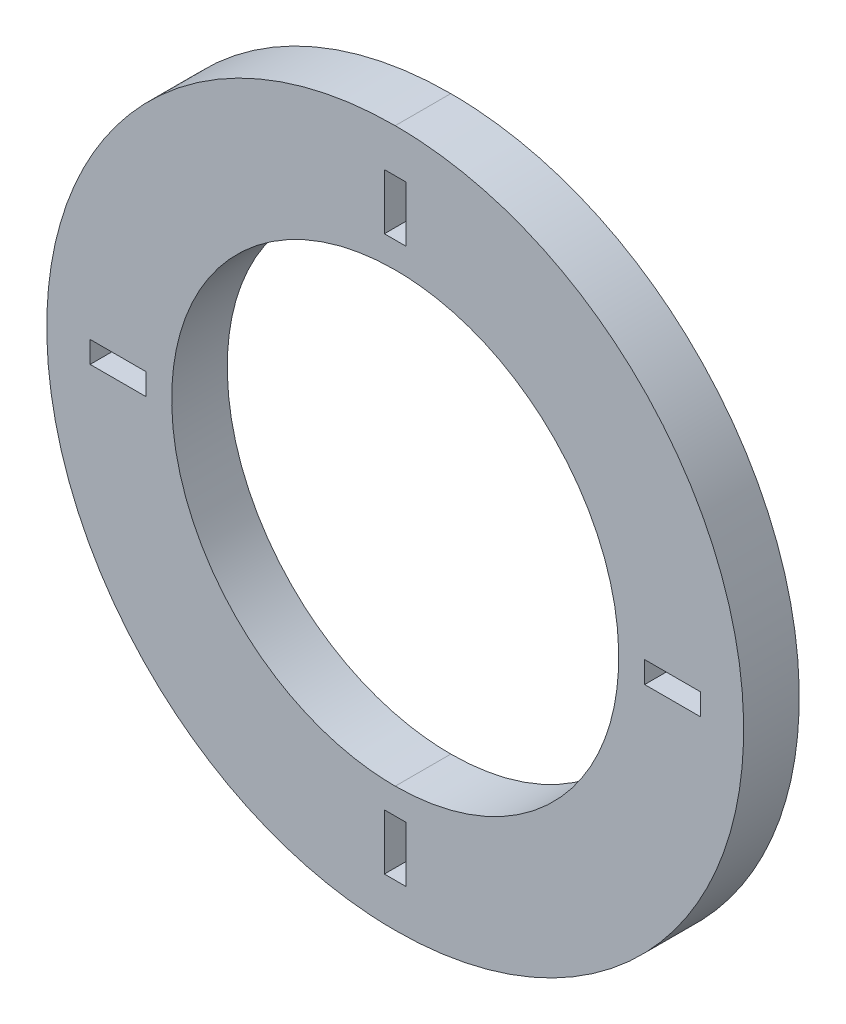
ISO-10303-21;
HEADER;
FILE_DESCRIPTION(('STEP AP214'),'2;1');
FILE_NAME('part.step','',(''),(''),'','','');
FILE_SCHEMA(('AUTOMOTIVE_DESIGN { 1 0 10303 214 1 1 1 1 }'));
ENDSEC;
DATA;
#1=APPLICATION_CONTEXT('core data for automotive mechanical design processes');
#2=APPLICATION_PROTOCOL_DEFINITION('international standard','automotive_design',2000,#1);
#3=PRODUCT_CONTEXT('',#1,'mechanical');
#4=PRODUCT('Part','Part','',(#3));
#5=PRODUCT_RELATED_PRODUCT_CATEGORY('part','',(#4));
#6=PRODUCT_DEFINITION_FORMATION('','',#4);
#7=PRODUCT_DEFINITION_CONTEXT('part definition',#1,'design');
#8=PRODUCT_DEFINITION('design','',#6,#7);
#9=PRODUCT_DEFINITION_SHAPE('','',#8);
#10=(LENGTH_UNIT() NAMED_UNIT(*) SI_UNIT(.MILLI.,.METRE.));
#11=(NAMED_UNIT(*) PLANE_ANGLE_UNIT() SI_UNIT($,.RADIAN.));
#12=(NAMED_UNIT(*) SI_UNIT($,.STERADIAN.) SOLID_ANGLE_UNIT());
#13=UNCERTAINTY_MEASURE_WITH_UNIT(LENGTH_MEASURE(1.E-05),#10,'distance_accuracy_value','');
#14=(GEOMETRIC_REPRESENTATION_CONTEXT(3) GLOBAL_UNCERTAINTY_ASSIGNED_CONTEXT((#13)) GLOBAL_UNIT_ASSIGNED_CONTEXT((#10,
#11,#12)) REPRESENTATION_CONTEXT('',''));
#15=CARTESIAN_POINT('',(0.,0.,0.));
#16=DIRECTION('',(0.,0.,1.));
#17=DIRECTION('',(1.,0.,0.));
#18=AXIS2_PLACEMENT_3D('',#15,#16,#17);
#19=CARTESIAN_POINT('',(231.78615355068,314.879839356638,3.));
#20=DIRECTION('',(0.,0.,-1.));
#21=DIRECTION('',(-1.,0.,0.));
#22=AXIS2_PLACEMENT_3D('',#19,#20,#21);
#23=PLANE('',#22);
#24=DIRECTION('',(0.,-1.,0.));
#25=VECTOR('',#24,1.);
#26=CARTESIAN_POINT('',(250.012092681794,328.344473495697,3.));
#27=LINE('',#26,#25);
#28=CARTESIAN_POINT('',(250.012092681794,331.346529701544,3.));
#29=VERTEX_POINT('',#28);
#30=CARTESIAN_POINT('',(250.012092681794,328.344473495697,3.));
#31=VERTEX_POINT('',#30);
#32=EDGE_CURVE('E235',#29,#31,#27,.T.);
#33=ORIENTED_EDGE('',*,*,#32,.F.);
#34=DIRECTION('',(-1.,0.,0.));
#35=VECTOR('',#34,1.);
#36=CARTESIAN_POINT('',(250.012092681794,331.346529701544,3.));
#37=LINE('',#36,#35);
#38=CARTESIAN_POINT('',(251.179807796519,331.346529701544,3.));
#39=VERTEX_POINT('',#38);
#40=EDGE_CURVE('E243',#39,#29,#37,.T.);
#41=ORIENTED_EDGE('',*,*,#40,.F.);
#42=DIRECTION('',(0.,1.,0.));
#43=VECTOR('',#42,1.);
#44=CARTESIAN_POINT('',(251.179807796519,331.346529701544,3.));
#45=LINE('',#44,#43);
#46=CARTESIAN_POINT('',(251.179807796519,328.344473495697,3.));
#47=VERTEX_POINT('',#46);
#48=EDGE_CURVE('E237',#47,#39,#45,.T.);
#49=ORIENTED_EDGE('',*,*,#48,.F.);
#50=DIRECTION('',(1.,0.,0.));
#51=VECTOR('',#50,1.);
#52=CARTESIAN_POINT('',(251.179807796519,328.344473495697,3.));
#53=LINE('',#52,#51);
#54=EDGE_CURVE('E232',#31,#47,#53,.T.);
#55=ORIENTED_EDGE('',*,*,#54,.F.);
#56=EDGE_LOOP('',(#33,#41,#49,#55));
#57=FACE_BOUND('',#56,.T.);
#58=CARTESIAN_POINT('',(250.595950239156,326.946109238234,3.));
#59=CARTESIAN_POINT('',(243.93188672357,326.946109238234,3.));
#60=CARTESIAN_POINT('',(238.529632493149,321.543855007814,3.));
#61=CARTESIAN_POINT('',(238.529632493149,314.879834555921,3.));
#62=CARTESIAN_POINT('',(238.529632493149,308.215641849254,3.));
#63=CARTESIAN_POINT('',(243.93188672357,302.813387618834,3.));
#64=CARTESIAN_POINT('',(250.595950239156,302.813387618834,3.));
#65=B_SPLINE_CURVE_WITH_KNOTS('',3,(#58,#59,#60,#61,#62,#63,#64),.UNSPECIFIED.,.F.,.F.,(4,3,4),
(0.,1.,2.),.UNSPECIFIED.);
#66=CARTESIAN_POINT('',(250.595950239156,326.946109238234,3.));
#67=VERTEX_POINT('',#66);
#68=CARTESIAN_POINT('',(250.595950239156,302.813387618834,3.));
#69=VERTEX_POINT('',#68);
#70=EDGE_CURVE('E319',#67,#69,#65,.T.);
#71=ORIENTED_EDGE('',*,*,#70,.F.);
#72=CARTESIAN_POINT('',(250.595950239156,302.813387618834,3.));
#73=CARTESIAN_POINT('',(257.260013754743,302.813387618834,3.));
#74=CARTESIAN_POINT('',(262.662267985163,308.215641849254,3.));
#75=CARTESIAN_POINT('',(262.662267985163,314.879834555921,3.));
#76=CARTESIAN_POINT('',(262.662267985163,321.543855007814,3.));
#77=CARTESIAN_POINT('',(257.260013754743,326.946109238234,3.));
#78=CARTESIAN_POINT('',(250.595950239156,326.946109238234,3.));
#79=B_SPLINE_CURVE_WITH_KNOTS('',3,(#72,#73,#74,#75,#76,#77,#78),.UNSPECIFIED.,.F.,.F.,(4,3,4),
(2.,3.,4.),.UNSPECIFIED.);
#80=EDGE_CURVE('E322',#69,#67,#79,.T.);
#81=ORIENTED_EDGE('',*,*,#80,.F.);
#82=EDGE_LOOP('',(#71,#81));
#83=FACE_BOUND('',#82,.T.);
#84=CARTESIAN_POINT('',(250.595950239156,333.689590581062,3.));
#85=CARTESIAN_POINT('',(240.207550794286,333.689590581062,3.));
#86=CARTESIAN_POINT('',(231.78615355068,325.268011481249,3.));
#87=CARTESIAN_POINT('',(231.78615355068,314.879839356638,3.));
#88=CARTESIAN_POINT('',(231.78615355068,304.491303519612,3.));
#89=CARTESIAN_POINT('',(240.207550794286,296.069906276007,3.));
#90=CARTESIAN_POINT('',(250.595950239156,296.069906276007,3.));
#91=B_SPLINE_CURVE_WITH_KNOTS('',3,(#84,#85,#86,#87,#88,#89,#90),.UNSPECIFIED.,.F.,.F.,(4,3,4),
(0.,1.,2.),.UNSPECIFIED.);
#92=CARTESIAN_POINT('',(250.595950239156,333.689590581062,3.));
#93=VERTEX_POINT('',#92);
#94=CARTESIAN_POINT('',(250.595950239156,296.069906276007,3.));
#95=VERTEX_POINT('',#94);
#96=EDGE_CURVE('E372',#93,#95,#91,.T.);
#97=ORIENTED_EDGE('',*,*,#96,.T.);
#98=CARTESIAN_POINT('',(250.595950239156,296.069906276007,3.));
#99=CARTESIAN_POINT('',(260.984349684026,296.069906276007,3.));
#100=CARTESIAN_POINT('',(269.405746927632,304.491303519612,3.));
#101=CARTESIAN_POINT('',(269.405746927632,314.879839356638,3.));
#102=CARTESIAN_POINT('',(269.405746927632,325.268011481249,3.));
#103=CARTESIAN_POINT('',(260.984349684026,333.689590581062,3.));
#104=CARTESIAN_POINT('',(250.595950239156,333.689590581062,3.));
#105=B_SPLINE_CURVE_WITH_KNOTS('',3,(#98,#99,#100,#101,#102,#103,#104),.UNSPECIFIED.,.F.,.F.,(4,
3,4),(2.,3.,4.),.UNSPECIFIED.);
#106=EDGE_CURVE('E368',#95,#93,#105,.T.);
#107=ORIENTED_EDGE('',*,*,#106,.T.);
#108=EDGE_LOOP('',(#97,#107));
#109=FACE_BOUND('',#108,.T.);
#110=DIRECTION('',(1.,0.,0.));
#111=VECTOR('',#110,1.);
#112=CARTESIAN_POINT('',(267.062731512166,314.295890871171,3.));
#113=LINE('',#112,#111);
#114=CARTESIAN_POINT('',(264.06067530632,314.295890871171,3.));
#115=VERTEX_POINT('',#114);
#116=CARTESIAN_POINT('',(267.062731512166,314.295890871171,3.));
#117=VERTEX_POINT('',#116);
#118=EDGE_CURVE('E433',#115,#117,#113,.T.);
#119=ORIENTED_EDGE('',*,*,#118,.F.);
#120=DIRECTION('',(0.,-1.,0.));
#121=VECTOR('',#120,1.);
#122=CARTESIAN_POINT('',(264.06067530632,314.295890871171,3.));
#123=LINE('',#122,#121);
#124=CARTESIAN_POINT('',(264.06067530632,315.463605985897,3.));
#125=VERTEX_POINT('',#124);
#126=EDGE_CURVE('E421',#125,#115,#123,.T.);
#127=ORIENTED_EDGE('',*,*,#126,.F.);
#128=DIRECTION('',(-1.,0.,0.));
#129=VECTOR('',#128,1.);
#130=CARTESIAN_POINT('',(264.06067530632,315.463605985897,3.));
#131=LINE('',#130,#129);
#132=CARTESIAN_POINT('',(267.062731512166,315.463605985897,3.));
#133=VERTEX_POINT('',#132);
#134=EDGE_CURVE('E428',#133,#125,#131,.T.);
#135=ORIENTED_EDGE('',*,*,#134,.F.);
#136=DIRECTION('',(0.,1.,0.));
#137=VECTOR('',#136,1.);
#138=CARTESIAN_POINT('',(267.062731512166,315.463605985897,3.));
#139=LINE('',#138,#137);
#140=EDGE_CURVE('E427',#117,#133,#139,.T.);
#141=ORIENTED_EDGE('',*,*,#140,.F.);
#142=EDGE_LOOP('',(#119,#127,#135,#141));
#143=FACE_BOUND('',#142,.T.);
#144=DIRECTION('',(0.,1.,0.));
#145=VECTOR('',#144,1.);
#146=CARTESIAN_POINT('',(251.179807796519,301.415023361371,3.));
#147=LINE('',#146,#145);
#148=CARTESIAN_POINT('',(251.179807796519,298.412967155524,3.));
#149=VERTEX_POINT('',#148);
#150=CARTESIAN_POINT('',(251.179807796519,301.415023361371,3.));
#151=VERTEX_POINT('',#150);
#152=EDGE_CURVE('E273',#149,#151,#147,.T.);
#153=ORIENTED_EDGE('',*,*,#152,.F.);
#154=DIRECTION('',(1.,0.,0.));
#155=VECTOR('',#154,1.);
#156=CARTESIAN_POINT('',(251.179807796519,298.412967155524,3.));
#157=LINE('',#156,#155);
#158=CARTESIAN_POINT('',(250.012092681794,298.412967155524,3.));
#159=VERTEX_POINT('',#158);
#160=EDGE_CURVE('E287',#159,#149,#157,.T.);
#161=ORIENTED_EDGE('',*,*,#160,.F.);
#162=DIRECTION('',(0.,-1.,0.));
#163=VECTOR('',#162,1.);
#164=CARTESIAN_POINT('',(250.012092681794,298.412967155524,3.));
#165=LINE('',#164,#163);
#166=CARTESIAN_POINT('',(250.012092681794,301.415023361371,3.));
#167=VERTEX_POINT('',#166);
#168=EDGE_CURVE('E282',#167,#159,#165,.T.);
#169=ORIENTED_EDGE('',*,*,#168,.F.);
#170=DIRECTION('',(-1.,0.,0.));
#171=VECTOR('',#170,1.);
#172=CARTESIAN_POINT('',(250.012092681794,301.415023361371,3.));
#173=LINE('',#172,#171);
#174=EDGE_CURVE('E280',#151,#167,#173,.T.);
#175=ORIENTED_EDGE('',*,*,#174,.F.);
#176=EDGE_LOOP('',(#153,#161,#169,#175));
#177=FACE_BOUND('',#176,.T.);
#178=DIRECTION('',(0.,1.,0.));
#179=VECTOR('',#178,1.);
#180=CARTESIAN_POINT('',(237.131225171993,315.463605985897,3.));
#181=LINE('',#180,#179);
#182=CARTESIAN_POINT('',(237.131225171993,314.295890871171,3.));
#183=VERTEX_POINT('',#182);
#184=CARTESIAN_POINT('',(237.131225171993,315.463605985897,3.));
#185=VERTEX_POINT('',#184);
#186=EDGE_CURVE('E183',#183,#185,#181,.T.);
#187=ORIENTED_EDGE('',*,*,#186,.F.);
#188=DIRECTION('',(1.,0.,0.));
#189=VECTOR('',#188,1.);
#190=CARTESIAN_POINT('',(237.131225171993,314.295890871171,3.));
#191=LINE('',#190,#189);
#192=CARTESIAN_POINT('',(234.129168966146,314.295890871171,3.));
#193=VERTEX_POINT('',#192);
#194=EDGE_CURVE('E208',#193,#183,#191,.T.);
#195=ORIENTED_EDGE('',*,*,#194,.F.);
#196=DIRECTION('',(0.,-1.,0.));
#197=VECTOR('',#196,1.);
#198=CARTESIAN_POINT('',(234.129168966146,314.295890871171,3.));
#199=LINE('',#198,#197);
#200=CARTESIAN_POINT('',(234.129168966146,315.463605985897,3.));
#201=VERTEX_POINT('',#200);
#202=EDGE_CURVE('E207',#201,#193,#199,.T.);
#203=ORIENTED_EDGE('',*,*,#202,.F.);
#204=DIRECTION('',(-1.,0.,0.));
#205=VECTOR('',#204,1.);
#206=CARTESIAN_POINT('',(234.129168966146,315.463605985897,3.));
#207=LINE('',#206,#205);
#208=EDGE_CURVE('E195',#185,#201,#207,.T.);
#209=ORIENTED_EDGE('',*,*,#208,.F.);
#210=EDGE_LOOP('',(#187,#195,#203,#209));
#211=FACE_BOUND('',#210,.T.);
#212=ADVANCED_FACE('F44',(#57,#83,#109,#143,#177,#211),#23,.F.);
#213=CARTESIAN_POINT('',(231.78615355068,314.879839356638,0.));
#214=DIRECTION('',(0.,0.,-1.));
#215=DIRECTION('',(-1.,0.,0.));
#216=AXIS2_PLACEMENT_3D('',#213,#214,#215);
#217=PLANE('',#216);
#218=CARTESIAN_POINT('',(250.595950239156,333.689590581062,0.));
#219=CARTESIAN_POINT('',(240.207550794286,333.689590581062,0.));
#220=CARTESIAN_POINT('',(231.78615355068,325.268011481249,0.));
#221=CARTESIAN_POINT('',(231.78615355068,314.879839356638,0.));
#222=CARTESIAN_POINT('',(231.78615355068,304.491303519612,0.));
#223=CARTESIAN_POINT('',(240.207550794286,296.069906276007,0.));
#224=CARTESIAN_POINT('',(250.595950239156,296.069906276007,0.));
#225=B_SPLINE_CURVE_WITH_KNOTS('',3,(#218,#219,#220,#221,#222,#223,#224),.UNSPECIFIED.,.F.,.F.,
(4,3,4),(0.,1.,2.),.UNSPECIFIED.);
#226=CARTESIAN_POINT('',(250.595950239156,333.689590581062,0.));
#227=VERTEX_POINT('',#226);
#228=CARTESIAN_POINT('',(250.595950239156,296.069906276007,0.));
#229=VERTEX_POINT('',#228);
#230=EDGE_CURVE('E378',#227,#229,#225,.T.);
#231=ORIENTED_EDGE('',*,*,#230,.F.);
#232=CARTESIAN_POINT('',(250.595950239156,296.069906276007,0.));
#233=CARTESIAN_POINT('',(260.984349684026,296.069906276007,0.));
#234=CARTESIAN_POINT('',(269.405746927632,304.491303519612,0.));
#235=CARTESIAN_POINT('',(269.405746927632,314.879839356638,0.));
#236=CARTESIAN_POINT('',(269.405746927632,325.268011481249,0.));
#237=CARTESIAN_POINT('',(260.984349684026,333.689590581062,0.));
#238=CARTESIAN_POINT('',(250.595950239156,333.689590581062,0.));
#239=B_SPLINE_CURVE_WITH_KNOTS('',3,(#232,#233,#234,#235,#236,#237,#238),.UNSPECIFIED.,.F.,.F.,
(4,3,4),(2.,3.,4.),.UNSPECIFIED.);
#240=EDGE_CURVE('E390',#229,#227,#239,.T.);
#241=ORIENTED_EDGE('',*,*,#240,.F.);
#242=EDGE_LOOP('',(#231,#241));
#243=FACE_BOUND('',#242,.T.);
#244=DIRECTION('',(0.,-1.,0.));
#245=VECTOR('',#244,1.);
#246=CARTESIAN_POINT('',(264.06067530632,314.295890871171,0.));
#247=LINE('',#246,#245);
#248=CARTESIAN_POINT('',(264.06067530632,315.463605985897,0.));
#249=VERTEX_POINT('',#248);
#250=CARTESIAN_POINT('',(264.06067530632,314.295890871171,0.));
#251=VERTEX_POINT('',#250);
#252=EDGE_CURVE('E436',#249,#251,#247,.T.);
#253=ORIENTED_EDGE('',*,*,#252,.T.);
#254=DIRECTION('',(1.,0.,0.));
#255=VECTOR('',#254,1.);
#256=CARTESIAN_POINT('',(267.062731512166,314.295890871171,0.));
#257=LINE('',#256,#255);
#258=CARTESIAN_POINT('',(267.062731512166,314.295890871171,0.));
#259=VERTEX_POINT('',#258);
#260=EDGE_CURVE('E449',#251,#259,#257,.T.);
#261=ORIENTED_EDGE('',*,*,#260,.T.);
#262=DIRECTION('',(0.,1.,0.));
#263=VECTOR('',#262,1.);
#264=CARTESIAN_POINT('',(267.062731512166,315.463605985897,0.));
#265=LINE('',#264,#263);
#266=CARTESIAN_POINT('',(267.062731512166,315.463605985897,0.));
#267=VERTEX_POINT('',#266);
#268=EDGE_CURVE('E443',#259,#267,#265,.T.);
#269=ORIENTED_EDGE('',*,*,#268,.T.);
#270=DIRECTION('',(-1.,0.,0.));
#271=VECTOR('',#270,1.);
#272=CARTESIAN_POINT('',(264.06067530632,315.463605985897,0.));
#273=LINE('',#272,#271);
#274=EDGE_CURVE('E439',#267,#249,#273,.T.);
#275=ORIENTED_EDGE('',*,*,#274,.T.);
#276=EDGE_LOOP('',(#253,#261,#269,#275));
#277=FACE_BOUND('',#276,.T.);
#278=CARTESIAN_POINT('',(250.595950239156,302.813387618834,0.));
#279=CARTESIAN_POINT('',(257.260013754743,302.813387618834,0.));
#280=CARTESIAN_POINT('',(262.662267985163,308.215641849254,0.));
#281=CARTESIAN_POINT('',(262.662267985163,314.879834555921,0.));
#282=CARTESIAN_POINT('',(262.662267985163,321.543855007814,0.));
#283=CARTESIAN_POINT('',(257.260013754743,326.946109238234,0.));
#284=CARTESIAN_POINT('',(250.595950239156,326.946109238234,0.));
#285=B_SPLINE_CURVE_WITH_KNOTS('',3,(#278,#279,#280,#281,#282,#283,#284),.UNSPECIFIED.,.F.,.F.,
(4,3,4),(2.,3.,4.),.UNSPECIFIED.);
#286=CARTESIAN_POINT('',(250.595950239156,302.813387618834,0.));
#287=VERTEX_POINT('',#286);
#288=CARTESIAN_POINT('',(250.595950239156,326.946109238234,0.));
#289=VERTEX_POINT('',#288);
#290=EDGE_CURVE('E326',#287,#289,#285,.T.);
#291=ORIENTED_EDGE('',*,*,#290,.T.);
#292=CARTESIAN_POINT('',(250.595950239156,326.946109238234,0.));
#293=CARTESIAN_POINT('',(243.93188672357,326.946109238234,0.));
#294=CARTESIAN_POINT('',(238.529632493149,321.543855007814,0.));
#295=CARTESIAN_POINT('',(238.529632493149,314.879834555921,0.));
#296=CARTESIAN_POINT('',(238.529632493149,308.215641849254,0.));
#297=CARTESIAN_POINT('',(243.93188672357,302.813387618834,0.));
#298=CARTESIAN_POINT('',(250.595950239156,302.813387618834,0.));
#299=B_SPLINE_CURVE_WITH_KNOTS('',3,(#292,#293,#294,#295,#296,#297,#298),.UNSPECIFIED.,.F.,.F.,
(4,3,4),(0.,1.,2.),.UNSPECIFIED.);
#300=EDGE_CURVE('E320',#289,#287,#299,.T.);
#301=ORIENTED_EDGE('',*,*,#300,.T.);
#302=EDGE_LOOP('',(#291,#301));
#303=FACE_BOUND('',#302,.T.);
#304=DIRECTION('',(1.,0.,0.));
#305=VECTOR('',#304,1.);
#306=CARTESIAN_POINT('',(251.179807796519,298.412967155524,0.));
#307=LINE('',#306,#305);
#308=CARTESIAN_POINT('',(250.012092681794,298.412967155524,0.));
#309=VERTEX_POINT('',#308);
#310=CARTESIAN_POINT('',(251.179807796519,298.412967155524,0.));
#311=VERTEX_POINT('',#310);
#312=EDGE_CURVE('E278',#309,#311,#307,.T.);
#313=ORIENTED_EDGE('',*,*,#312,.T.);
#314=DIRECTION('',(0.,1.,0.));
#315=VECTOR('',#314,1.);
#316=CARTESIAN_POINT('',(251.179807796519,301.415023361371,0.));
#317=LINE('',#316,#315);
#318=CARTESIAN_POINT('',(251.179807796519,301.415023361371,0.));
#319=VERTEX_POINT('',#318);
#320=EDGE_CURVE('E274',#311,#319,#317,.T.);
#321=ORIENTED_EDGE('',*,*,#320,.T.);
#322=DIRECTION('',(-1.,0.,0.));
#323=VECTOR('',#322,1.);
#324=CARTESIAN_POINT('',(250.012092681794,301.415023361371,0.));
#325=LINE('',#324,#323);
#326=CARTESIAN_POINT('',(250.012092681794,301.415023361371,0.));
#327=VERTEX_POINT('',#326);
#328=EDGE_CURVE('E291',#319,#327,#325,.T.);
#329=ORIENTED_EDGE('',*,*,#328,.T.);
#330=DIRECTION('',(0.,-1.,0.));
#331=VECTOR('',#330,1.);
#332=CARTESIAN_POINT('',(250.012092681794,298.412967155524,0.));
#333=LINE('',#332,#331);
#334=EDGE_CURVE('E300',#327,#309,#333,.T.);
#335=ORIENTED_EDGE('',*,*,#334,.T.);
#336=EDGE_LOOP('',(#313,#321,#329,#335));
#337=FACE_BOUND('',#336,.T.);
#338=DIRECTION('',(-1.,0.,0.));
#339=VECTOR('',#338,1.);
#340=CARTESIAN_POINT('',(250.012092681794,331.346529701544,0.));
#341=LINE('',#340,#339);
#342=CARTESIAN_POINT('',(251.179807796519,331.346529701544,0.));
#343=VERTEX_POINT('',#342);
#344=CARTESIAN_POINT('',(250.012092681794,331.346529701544,0.));
#345=VERTEX_POINT('',#344);
#346=EDGE_CURVE('E236',#343,#345,#341,.T.);
#347=ORIENTED_EDGE('',*,*,#346,.T.);
#348=DIRECTION('',(0.,-1.,0.));
#349=VECTOR('',#348,1.);
#350=CARTESIAN_POINT('',(250.012092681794,328.344473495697,0.));
#351=LINE('',#350,#349);
#352=CARTESIAN_POINT('',(250.012092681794,328.344473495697,0.));
#353=VERTEX_POINT('',#352);
#354=EDGE_CURVE('E205',#345,#353,#351,.T.);
#355=ORIENTED_EDGE('',*,*,#354,.T.);
#356=DIRECTION('',(1.,0.,0.));
#357=VECTOR('',#356,1.);
#358=CARTESIAN_POINT('',(251.179807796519,328.344473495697,0.));
#359=LINE('',#358,#357);
#360=CARTESIAN_POINT('',(251.179807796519,328.344473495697,0.));
#361=VERTEX_POINT('',#360);
#362=EDGE_CURVE('E249',#353,#361,#359,.T.);
#363=ORIENTED_EDGE('',*,*,#362,.T.);
#364=DIRECTION('',(0.,1.,0.));
#365=VECTOR('',#364,1.);
#366=CARTESIAN_POINT('',(251.179807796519,331.346529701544,0.));
#367=LINE('',#366,#365);
#368=EDGE_CURVE('E251',#361,#343,#367,.T.);
#369=ORIENTED_EDGE('',*,*,#368,.T.);
#370=EDGE_LOOP('',(#347,#355,#363,#369));
#371=FACE_BOUND('',#370,.T.);
#372=DIRECTION('',(1.,0.,0.));
#373=VECTOR('',#372,1.);
#374=CARTESIAN_POINT('',(237.131225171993,314.295890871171,0.));
#375=LINE('',#374,#373);
#376=CARTESIAN_POINT('',(234.129168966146,314.295890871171,0.));
#377=VERTEX_POINT('',#376);
#378=CARTESIAN_POINT('',(237.131225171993,314.295890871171,0.));
#379=VERTEX_POINT('',#378);
#380=EDGE_CURVE('E193',#377,#379,#375,.T.);
#381=ORIENTED_EDGE('',*,*,#380,.T.);
#382=DIRECTION('',(0.,1.,0.));
#383=VECTOR('',#382,1.);
#384=CARTESIAN_POINT('',(237.131225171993,315.463605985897,0.));
#385=LINE('',#384,#383);
#386=CARTESIAN_POINT('',(237.131225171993,315.463605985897,0.));
#387=VERTEX_POINT('',#386);
#388=EDGE_CURVE('E70',#379,#387,#385,.T.);
#389=ORIENTED_EDGE('',*,*,#388,.T.);
#390=DIRECTION('',(-1.,0.,0.));
#391=VECTOR('',#390,1.);
#392=CARTESIAN_POINT('',(234.129168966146,315.463605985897,0.));
#393=LINE('',#392,#391);
#394=CARTESIAN_POINT('',(234.129168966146,315.463605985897,0.));
#395=VERTEX_POINT('',#394);
#396=EDGE_CURVE('E200',#387,#395,#393,.T.);
#397=ORIENTED_EDGE('',*,*,#396,.T.);
#398=DIRECTION('',(0.,-1.,0.));
#399=VECTOR('',#398,1.);
#400=CARTESIAN_POINT('',(234.129168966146,314.295890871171,0.));
#401=LINE('',#400,#399);
#402=EDGE_CURVE('E218',#395,#377,#401,.T.);
#403=ORIENTED_EDGE('',*,*,#402,.T.);
#404=EDGE_LOOP('',(#381,#389,#397,#403));
#405=FACE_BOUND('',#404,.T.);
#406=ADVANCED_FACE('F363',(#243,#277,#303,#337,#371,#405),#217,.T.);
#407=DIRECTION('',(0.,0.,-1.));
#408=VECTOR('',#407,1.);
#409=SURFACE_OF_LINEAR_EXTRUSION('',#91,#408);
#410=ORIENTED_EDGE('',*,*,#230,.T.);
#411=DIRECTION('',(0.,0.,-1.));
#412=VECTOR('',#411,1.);
#413=CARTESIAN_POINT('',(250.595950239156,296.069906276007,3.));
#414=LINE('',#413,#412);
#415=EDGE_CURVE('E11',#95,#229,#414,.T.);
#416=ORIENTED_EDGE('',*,*,#415,.F.);
#417=ORIENTED_EDGE('',*,*,#96,.F.);
#418=DIRECTION('',(0.,0.,-1.));
#419=VECTOR('',#418,1.);
#420=CARTESIAN_POINT('',(250.595950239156,333.689590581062,3.));
#421=LINE('',#420,#419);
#422=EDGE_CURVE('E54',#93,#227,#421,.T.);
#423=ORIENTED_EDGE('',*,*,#422,.T.);
#424=EDGE_LOOP('',(#410,#416,#417,#423));
#425=FACE_BOUND('',#424,.T.);
#426=ADVANCED_FACE('F50',(#425),#409,.F.);
#427=DIRECTION('',(0.,0.,-1.));
#428=VECTOR('',#427,1.);
#429=SURFACE_OF_LINEAR_EXTRUSION('',#105,#428);
#430=ORIENTED_EDGE('',*,*,#240,.T.);
#431=ORIENTED_EDGE('',*,*,#422,.F.);
#432=ORIENTED_EDGE('',*,*,#106,.F.);
#433=ORIENTED_EDGE('',*,*,#415,.T.);
#434=EDGE_LOOP('',(#430,#431,#432,#433));
#435=FACE_BOUND('',#434,.T.);
#436=ADVANCED_FACE('F357',(#435),#429,.F.);
#437=CARTESIAN_POINT('',(267.062731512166,314.295890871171,3.));
#438=DIRECTION('',(0.,1.,0.));
#439=DIRECTION('',(0.,0.,1.));
#440=AXIS2_PLACEMENT_3D('',#437,#438,#439);
#441=PLANE('',#440);
#442=ORIENTED_EDGE('',*,*,#260,.F.);
#443=DIRECTION('',(0.,0.,-1.));
#444=VECTOR('',#443,1.);
#445=CARTESIAN_POINT('',(264.06067530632,314.295890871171,3.));
#446=LINE('',#445,#444);
#447=EDGE_CURVE('E416',#115,#251,#446,.T.);
#448=ORIENTED_EDGE('',*,*,#447,.F.);
#449=ORIENTED_EDGE('',*,*,#118,.T.);
#450=DIRECTION('',(0.,0.,-1.));
#451=VECTOR('',#450,1.);
#452=CARTESIAN_POINT('',(267.062731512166,314.295890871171,3.));
#453=LINE('',#452,#451);
#454=EDGE_CURVE('E388',#117,#259,#453,.T.);
#455=ORIENTED_EDGE('',*,*,#454,.T.);
#456=EDGE_LOOP('',(#442,#448,#449,#455));
#457=FACE_BOUND('',#456,.T.);
#458=ADVANCED_FACE('F354',(#457),#441,.T.);
#459=CARTESIAN_POINT('',(267.062731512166,315.463605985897,3.));
#460=DIRECTION('',(-1.,0.,0.));
#461=DIRECTION('',(0.,0.,1.));
#462=AXIS2_PLACEMENT_3D('',#459,#460,#461);
#463=PLANE('',#462);
#464=ORIENTED_EDGE('',*,*,#268,.F.);
#465=ORIENTED_EDGE('',*,*,#454,.F.);
#466=ORIENTED_EDGE('',*,*,#140,.T.);
#467=DIRECTION('',(0.,0.,-1.));
#468=VECTOR('',#467,1.);
#469=CARTESIAN_POINT('',(267.062731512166,315.463605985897,3.));
#470=LINE('',#469,#468);
#471=EDGE_CURVE('E413',#133,#267,#470,.T.);
#472=ORIENTED_EDGE('',*,*,#471,.T.);
#473=EDGE_LOOP('',(#464,#465,#466,#472));
#474=FACE_BOUND('',#473,.T.);
#475=ADVANCED_FACE('F348',(#474),#463,.T.);
#476=CARTESIAN_POINT('',(264.06067530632,315.463605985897,3.));
#477=DIRECTION('',(0.,-1.,0.));
#478=DIRECTION('',(0.,0.,-1.));
#479=AXIS2_PLACEMENT_3D('',#476,#477,#478);
#480=PLANE('',#479);
#481=ORIENTED_EDGE('',*,*,#274,.F.);
#482=ORIENTED_EDGE('',*,*,#471,.F.);
#483=ORIENTED_EDGE('',*,*,#134,.T.);
#484=DIRECTION('',(0.,0.,-1.));
#485=VECTOR('',#484,1.);
#486=CARTESIAN_POINT('',(264.06067530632,315.463605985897,3.));
#487=LINE('',#486,#485);
#488=EDGE_CURVE('E417',#125,#249,#487,.T.);
#489=ORIENTED_EDGE('',*,*,#488,.T.);
#490=EDGE_LOOP('',(#481,#482,#483,#489));
#491=FACE_BOUND('',#490,.T.);
#492=ADVANCED_FACE('F342',(#491),#480,.T.);
#493=CARTESIAN_POINT('',(264.06067530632,314.295890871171,3.));
#494=DIRECTION('',(1.,0.,0.));
#495=DIRECTION('',(0.,0.,-1.));
#496=AXIS2_PLACEMENT_3D('',#493,#494,#495);
#497=PLANE('',#496);
#498=ORIENTED_EDGE('',*,*,#252,.F.);
#499=ORIENTED_EDGE('',*,*,#488,.F.);
#500=ORIENTED_EDGE('',*,*,#126,.T.);
#501=ORIENTED_EDGE('',*,*,#447,.T.);
#502=EDGE_LOOP('',(#498,#499,#500,#501));
#503=FACE_BOUND('',#502,.T.);
#504=ADVANCED_FACE('F338',(#503),#497,.T.);
#505=DIRECTION('',(0.,0.,-1.));
#506=VECTOR('',#505,1.);
#507=SURFACE_OF_LINEAR_EXTRUSION('',#65,#506);
#508=ORIENTED_EDGE('',*,*,#300,.F.);
#509=DIRECTION('',(0.,0.,-1.));
#510=VECTOR('',#509,1.);
#511=CARTESIAN_POINT('',(250.595950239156,326.946109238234,3.));
#512=LINE('',#511,#510);
#513=EDGE_CURVE('E456',#67,#289,#512,.T.);
#514=ORIENTED_EDGE('',*,*,#513,.F.);
#515=ORIENTED_EDGE('',*,*,#70,.T.);
#516=DIRECTION('',(0.,0.,-1.));
#517=VECTOR('',#516,1.);
#518=CARTESIAN_POINT('',(250.595950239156,302.813387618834,3.));
#519=LINE('',#518,#517);
#520=EDGE_CURVE('E451',#69,#287,#519,.T.);
#521=ORIENTED_EDGE('',*,*,#520,.T.);
#522=EDGE_LOOP('',(#508,#514,#515,#521));
#523=FACE_BOUND('',#522,.T.);
#524=ADVANCED_FACE('F333',(#523),#507,.T.);
#525=DIRECTION('',(0.,0.,-1.));
#526=VECTOR('',#525,1.);
#527=SURFACE_OF_LINEAR_EXTRUSION('',#79,#526);
#528=ORIENTED_EDGE('',*,*,#290,.F.);
#529=ORIENTED_EDGE('',*,*,#520,.F.);
#530=ORIENTED_EDGE('',*,*,#80,.T.);
#531=ORIENTED_EDGE('',*,*,#513,.T.);
#532=EDGE_LOOP('',(#528,#529,#530,#531));
#533=FACE_BOUND('',#532,.T.);
#534=ADVANCED_FACE('F339',(#533),#527,.T.);
#535=CARTESIAN_POINT('',(251.179807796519,301.415023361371,3.));
#536=DIRECTION('',(-1.,0.,0.));
#537=DIRECTION('',(0.,0.,1.));
#538=AXIS2_PLACEMENT_3D('',#535,#536,#537);
#539=PLANE('',#538);
#540=ORIENTED_EDGE('',*,*,#320,.F.);
#541=DIRECTION('',(0.,0.,-1.));
#542=VECTOR('',#541,1.);
#543=CARTESIAN_POINT('',(251.179807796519,298.412967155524,3.));
#544=LINE('',#543,#542);
#545=EDGE_CURVE('E286',#149,#311,#544,.T.);
#546=ORIENTED_EDGE('',*,*,#545,.F.);
#547=ORIENTED_EDGE('',*,*,#152,.T.);
#548=DIRECTION('',(0.,0.,-1.));
#549=VECTOR('',#548,1.);
#550=CARTESIAN_POINT('',(251.179807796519,301.415023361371,3.));
#551=LINE('',#550,#549);
#552=EDGE_CURVE('E312',#151,#319,#551,.T.);
#553=ORIENTED_EDGE('',*,*,#552,.T.);
#554=EDGE_LOOP('',(#540,#546,#547,#553));
#555=FACE_BOUND('',#554,.T.);
#556=ADVANCED_FACE('F481',(#555),#539,.T.);
#557=CARTESIAN_POINT('',(250.012092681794,301.415023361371,3.));
#558=DIRECTION('',(0.,-1.,0.));
#559=DIRECTION('',(0.,0.,-1.));
#560=AXIS2_PLACEMENT_3D('',#557,#558,#559);
#561=PLANE('',#560);
#562=ORIENTED_EDGE('',*,*,#328,.F.);
#563=ORIENTED_EDGE('',*,*,#552,.F.);
#564=ORIENTED_EDGE('',*,*,#174,.T.);
#565=DIRECTION('',(0.,0.,-1.));
#566=VECTOR('',#565,1.);
#567=CARTESIAN_POINT('',(250.012092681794,301.415023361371,3.));
#568=LINE('',#567,#566);
#569=EDGE_CURVE('E309',#167,#327,#568,.T.);
#570=ORIENTED_EDGE('',*,*,#569,.T.);
#571=EDGE_LOOP('',(#562,#563,#564,#570));
#572=FACE_BOUND('',#571,.T.);
#573=ADVANCED_FACE('F486',(#572),#561,.T.);
#574=CARTESIAN_POINT('',(250.012092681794,298.412967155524,3.));
#575=DIRECTION('',(1.,0.,0.));
#576=DIRECTION('',(0.,0.,-1.));
#577=AXIS2_PLACEMENT_3D('',#574,#575,#576);
#578=PLANE('',#577);
#579=ORIENTED_EDGE('',*,*,#334,.F.);
#580=ORIENTED_EDGE('',*,*,#569,.F.);
#581=ORIENTED_EDGE('',*,*,#168,.T.);
#582=DIRECTION('',(0.,0.,-1.));
#583=VECTOR('',#582,1.);
#584=CARTESIAN_POINT('',(250.012092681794,298.412967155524,3.));
#585=LINE('',#584,#583);
#586=EDGE_CURVE('E310',#159,#309,#585,.T.);
#587=ORIENTED_EDGE('',*,*,#586,.T.);
#588=EDGE_LOOP('',(#579,#580,#581,#587));
#589=FACE_BOUND('',#588,.T.);
#590=ADVANCED_FACE('F491',(#589),#578,.T.);
#591=CARTESIAN_POINT('',(251.179807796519,298.412967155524,3.));
#592=DIRECTION('',(0.,1.,0.));
#593=DIRECTION('',(0.,0.,1.));
#594=AXIS2_PLACEMENT_3D('',#591,#592,#593);
#595=PLANE('',#594);
#596=ORIENTED_EDGE('',*,*,#312,.F.);
#597=ORIENTED_EDGE('',*,*,#586,.F.);
#598=ORIENTED_EDGE('',*,*,#160,.T.);
#599=ORIENTED_EDGE('',*,*,#545,.T.);
#600=EDGE_LOOP('',(#596,#597,#598,#599));
#601=FACE_BOUND('',#600,.T.);
#602=ADVANCED_FACE('F497',(#601),#595,.T.);
#603=CARTESIAN_POINT('',(250.012092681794,328.344473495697,3.));
#604=DIRECTION('',(1.,0.,0.));
#605=DIRECTION('',(0.,0.,-1.));
#606=AXIS2_PLACEMENT_3D('',#603,#604,#605);
#607=PLANE('',#606);
#608=ORIENTED_EDGE('',*,*,#354,.F.);
#609=DIRECTION('',(0.,0.,-1.));
#610=VECTOR('',#609,1.);
#611=CARTESIAN_POINT('',(250.012092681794,331.346529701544,3.));
#612=LINE('',#611,#610);
#613=EDGE_CURVE('E246',#29,#345,#612,.T.);
#614=ORIENTED_EDGE('',*,*,#613,.F.);
#615=ORIENTED_EDGE('',*,*,#32,.T.);
#616=DIRECTION('',(0.,0.,-1.));
#617=VECTOR('',#616,1.);
#618=CARTESIAN_POINT('',(250.012092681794,328.344473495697,3.));
#619=LINE('',#618,#617);
#620=EDGE_CURVE('E268',#31,#353,#619,.T.);
#621=ORIENTED_EDGE('',*,*,#620,.T.);
#622=EDGE_LOOP('',(#608,#614,#615,#621));
#623=FACE_BOUND('',#622,.T.);
#624=ADVANCED_FACE('F503',(#623),#607,.T.);
#625=CARTESIAN_POINT('',(251.179807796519,328.344473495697,3.));
#626=DIRECTION('',(0.,1.,0.));
#627=DIRECTION('',(0.,0.,1.));
#628=AXIS2_PLACEMENT_3D('',#625,#626,#627);
#629=PLANE('',#628);
#630=ORIENTED_EDGE('',*,*,#362,.F.);
#631=ORIENTED_EDGE('',*,*,#620,.F.);
#632=ORIENTED_EDGE('',*,*,#54,.T.);
#633=DIRECTION('',(0.,0.,-1.));
#634=VECTOR('',#633,1.);
#635=CARTESIAN_POINT('',(251.179807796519,328.344473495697,3.));
#636=LINE('',#635,#634);
#637=EDGE_CURVE('E270',#47,#361,#636,.T.);
#638=ORIENTED_EDGE('',*,*,#637,.T.);
#639=EDGE_LOOP('',(#630,#631,#632,#638));
#640=FACE_BOUND('',#639,.T.);
#641=ADVANCED_FACE('F510',(#640),#629,.T.);
#642=CARTESIAN_POINT('',(251.179807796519,331.346529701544,3.));
#643=DIRECTION('',(-1.,0.,0.));
#644=DIRECTION('',(0.,0.,1.));
#645=AXIS2_PLACEMENT_3D('',#642,#643,#644);
#646=PLANE('',#645);
#647=ORIENTED_EDGE('',*,*,#368,.F.);
#648=ORIENTED_EDGE('',*,*,#637,.F.);
#649=ORIENTED_EDGE('',*,*,#48,.T.);
#650=DIRECTION('',(0.,0.,-1.));
#651=VECTOR('',#650,1.);
#652=CARTESIAN_POINT('',(251.179807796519,331.346529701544,3.));
#653=LINE('',#652,#651);
#654=EDGE_CURVE('E263',#39,#343,#653,.T.);
#655=ORIENTED_EDGE('',*,*,#654,.T.);
#656=EDGE_LOOP('',(#647,#648,#649,#655));
#657=FACE_BOUND('',#656,.T.);
#658=ADVANCED_FACE('F512',(#657),#646,.T.);
#659=CARTESIAN_POINT('',(250.012092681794,331.346529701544,3.));
#660=DIRECTION('',(0.,-1.,0.));
#661=DIRECTION('',(0.,0.,-1.));
#662=AXIS2_PLACEMENT_3D('',#659,#660,#661);
#663=PLANE('',#662);
#664=ORIENTED_EDGE('',*,*,#346,.F.);
#665=ORIENTED_EDGE('',*,*,#654,.F.);
#666=ORIENTED_EDGE('',*,*,#40,.T.);
#667=ORIENTED_EDGE('',*,*,#613,.T.);
#668=EDGE_LOOP('',(#664,#665,#666,#667));
#669=FACE_BOUND('',#668,.T.);
#670=ADVANCED_FACE('F513',(#669),#663,.T.);
#671=CARTESIAN_POINT('',(237.131225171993,315.463605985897,3.));
#672=DIRECTION('',(-1.,0.,0.));
#673=DIRECTION('',(0.,0.,1.));
#674=AXIS2_PLACEMENT_3D('',#671,#672,#673);
#675=PLANE('',#674);
#676=ORIENTED_EDGE('',*,*,#388,.F.);
#677=DIRECTION('',(0.,0.,-1.));
#678=VECTOR('',#677,1.);
#679=CARTESIAN_POINT('',(237.131225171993,314.295890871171,3.));
#680=LINE('',#679,#678);
#681=EDGE_CURVE('E189',#183,#379,#680,.T.);
#682=ORIENTED_EDGE('',*,*,#681,.F.);
#683=ORIENTED_EDGE('',*,*,#186,.T.);
#684=DIRECTION('',(0.,0.,-1.));
#685=VECTOR('',#684,1.);
#686=CARTESIAN_POINT('',(237.131225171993,315.463605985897,3.));
#687=LINE('',#686,#685);
#688=EDGE_CURVE('E190',#185,#387,#687,.T.);
#689=ORIENTED_EDGE('',*,*,#688,.T.);
#690=EDGE_LOOP('',(#676,#682,#683,#689));
#691=FACE_BOUND('',#690,.T.);
#692=ADVANCED_FACE('F187',(#691),#675,.T.);
#693=CARTESIAN_POINT('',(234.129168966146,315.463605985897,3.));
#694=DIRECTION('',(0.,-1.,0.));
#695=DIRECTION('',(0.,0.,-1.));
#696=AXIS2_PLACEMENT_3D('',#693,#694,#695);
#697=PLANE('',#696);
#698=ORIENTED_EDGE('',*,*,#396,.F.);
#699=ORIENTED_EDGE('',*,*,#688,.F.);
#700=ORIENTED_EDGE('',*,*,#208,.T.);
#701=DIRECTION('',(0.,0.,-1.));
#702=VECTOR('',#701,1.);
#703=CARTESIAN_POINT('',(234.129168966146,315.463605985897,3.));
#704=LINE('',#703,#702);
#705=EDGE_CURVE('E204',#201,#395,#704,.T.);
#706=ORIENTED_EDGE('',*,*,#705,.T.);
#707=EDGE_LOOP('',(#698,#699,#700,#706));
#708=FACE_BOUND('',#707,.T.);
#709=ADVANCED_FACE('F197',(#708),#697,.T.);
#710=CARTESIAN_POINT('',(234.129168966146,314.295890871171,3.));
#711=DIRECTION('',(1.,0.,0.));
#712=DIRECTION('',(0.,0.,-1.));
#713=AXIS2_PLACEMENT_3D('',#710,#711,#712);
#714=PLANE('',#713);
#715=ORIENTED_EDGE('',*,*,#402,.F.);
#716=ORIENTED_EDGE('',*,*,#705,.F.);
#717=ORIENTED_EDGE('',*,*,#202,.T.);
#718=DIRECTION('',(0.,0.,-1.));
#719=VECTOR('',#718,1.);
#720=CARTESIAN_POINT('',(234.129168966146,314.295890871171,3.));
#721=LINE('',#720,#719);
#722=EDGE_CURVE('E61',#193,#377,#721,.T.);
#723=ORIENTED_EDGE('',*,*,#722,.T.);
#724=EDGE_LOOP('',(#715,#716,#717,#723));
#725=FACE_BOUND('',#724,.T.);
#726=ADVANCED_FACE('F523',(#725),#714,.T.);
#727=CARTESIAN_POINT('',(237.131225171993,314.295890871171,3.));
#728=DIRECTION('',(0.,1.,0.));
#729=DIRECTION('',(0.,0.,1.));
#730=AXIS2_PLACEMENT_3D('',#727,#728,#729);
#731=PLANE('',#730);
#732=ORIENTED_EDGE('',*,*,#380,.F.);
#733=ORIENTED_EDGE('',*,*,#722,.F.);
#734=ORIENTED_EDGE('',*,*,#194,.T.);
#735=ORIENTED_EDGE('',*,*,#681,.T.);
#736=EDGE_LOOP('',(#732,#733,#734,#735));
#737=FACE_BOUND('',#736,.T.);
#738=ADVANCED_FACE('F530',(#737),#731,.T.);
#739=CLOSED_SHELL('',(#212,#406,#426,#436,#458,#475,#492,#504,#524,#534,#556,#573,#590,#602,
#624,#641,#658,#670,#692,#709,#726,#738));
#740=MANIFOLD_SOLID_BREP('B2',#739);
#741=ADVANCED_BREP_SHAPE_REPRESENTATION('',(#18,#740),#14);
#742=SHAPE_DEFINITION_REPRESENTATION(#9,#741);
ENDSEC;
END-ISO-10303-21;
